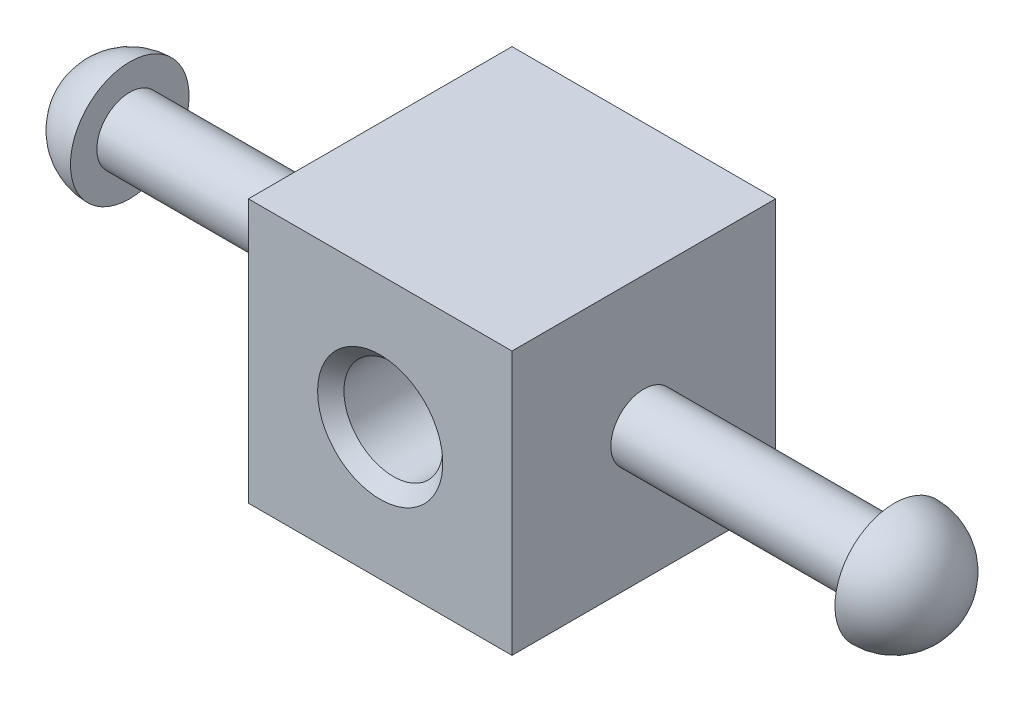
from build123d import *

# Parameters (mm, degrees)
SKETCH1_W           = 25.4
SKETCH1_H           = 25.4
SKETCH1_R           = 4.7625
BOSS_EXTRUDE1_DEPTH = 25.4
SKETCH2_R           = 3.175
BOSS_EXTRUDE2_DEPTH = 24.13
CHAMFER1_SIZE       = 1.27


with BuildPart() as part:
    # Sketch1 → Boss-Extrude1 (new body)
    with BuildSketch(Plane.XY):
        with Locations((12.7, 12.7)):
            Rectangle(SKETCH1_W, SKETCH1_H)
        with Locations((12.7, 12.7)):
            Circle(SKETCH1_R, mode=Mode.SUBTRACT)
    extrude(amount=BOSS_EXTRUDE1_DEPTH)

    # Sketch2 → Boss-Extrude2 (add)
    with BuildSketch(Plane(origin=(25.4, 0, 0), x_dir=(0, 0, -1), z_dir=(1, 0, 0))):
        with Locations(Location((-12.7, 12.7, 0), (0, 0, 270))):
            Circle(SKETCH2_R)
    extrude(amount=BOSS_EXTRUDE2_DEPTH)

    # Sketch5 → Revolve1 (revolve)
    with BuildSketch(Plane(origin=(0, 0, 12.7), x_dir=(0, -1, 0), z_dir=(0, 0, -1))):
        with BuildLine():
            Line((-12.7, -49.53), (-18.415, -49.53))
            ThreePointArc((-18.415, -49.53), (-16.741115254, -53.571115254), (-12.7, -55.245))
            Line((-12.7, -55.245), (-12.7, -49.53))
        make_face()
    revolve(axis=Axis((55.245, 12.7, 12.7), (-1, 0, 0)))

    # Sketch6 → Revolve2 (revolve)
    with BuildSketch(Plane(origin=(0, 0, 12.7), x_dir=(0, -1, 0), z_dir=(0, 0, -1))):
        with BuildLine():
            Line((-12.7, 0), (-12.7, 24.13))
            Line((-12.7, 24.13), (-12.7, 29.845))
            ThreePointArc((-12.7, 29.845), (-16.741115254, 28.171115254), (-18.415, 24.13))
            Line((-18.415, 24.13), (-15.875, 24.13))
            Line((-15.875, 24.13), (-15.875, 0))
            Line((-15.875, 0), (-12.7, 0))
        make_face()
    revolve(axis=Axis((0, 12.7, 12.7), (-1, 0, 0)))

    # Chamfer1
    chamfer1_edges = [part.edges().sort_by_distance(p)[0] for p in [
        (7.9375, 12.7, 0),
        (7.9375, 12.7, 25.4),
    ]]
    chamfer(chamfer1_edges, length=CHAMFER1_SIZE)


solid = part.part
